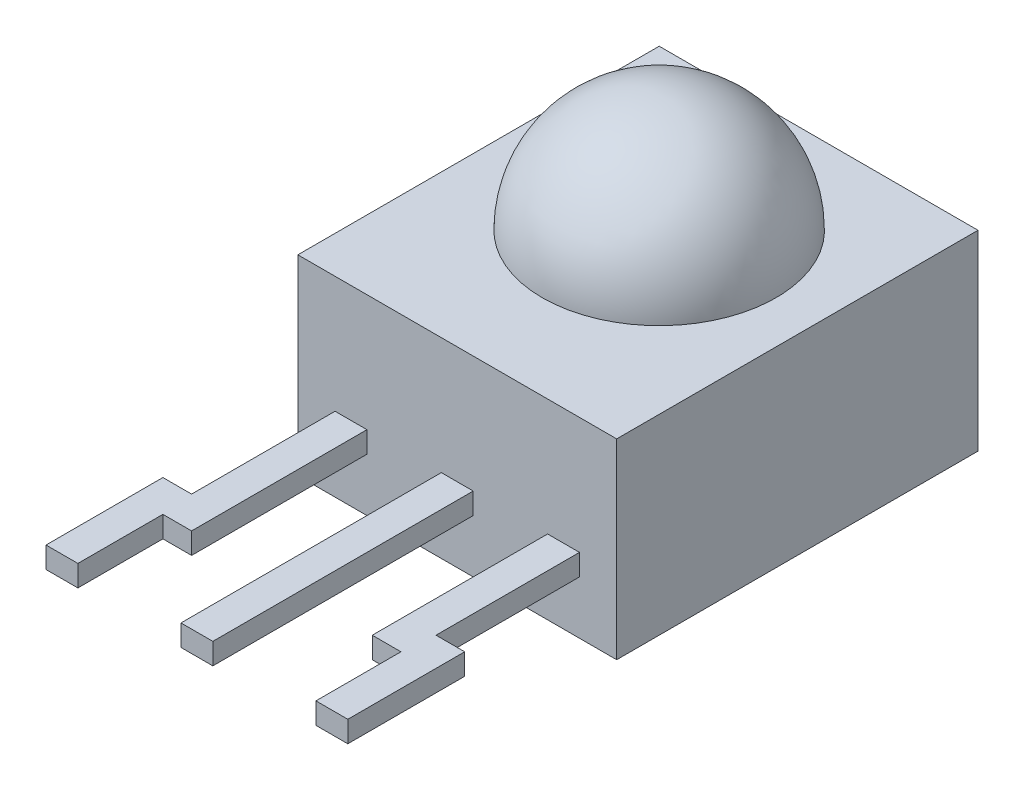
ISO-10303-21;
HEADER;
FILE_DESCRIPTION(('STEP AP214'),'2;1');
FILE_NAME('part.step','',(''),(''),'','','');
FILE_SCHEMA(('AUTOMOTIVE_DESIGN { 1 0 10303 214 1 1 1 1 }'));
ENDSEC;
DATA;
#1=APPLICATION_CONTEXT('core data for automotive mechanical design processes');
#2=APPLICATION_PROTOCOL_DEFINITION('international standard','automotive_design',2000,#1);
#3=PRODUCT_CONTEXT('',#1,'mechanical');
#4=PRODUCT('Part','Part','',(#3));
#5=PRODUCT_RELATED_PRODUCT_CATEGORY('part','',(#4));
#6=PRODUCT_DEFINITION_FORMATION('','',#4);
#7=PRODUCT_DEFINITION_CONTEXT('part definition',#1,'design');
#8=PRODUCT_DEFINITION('design','',#6,#7);
#9=PRODUCT_DEFINITION_SHAPE('','',#8);
#10=(LENGTH_UNIT() NAMED_UNIT(*) SI_UNIT(.MILLI.,.METRE.));
#11=(NAMED_UNIT(*) PLANE_ANGLE_UNIT() SI_UNIT($,.RADIAN.));
#12=(NAMED_UNIT(*) SI_UNIT($,.STERADIAN.) SOLID_ANGLE_UNIT());
#13=UNCERTAINTY_MEASURE_WITH_UNIT(LENGTH_MEASURE(1.E-05),#10,'distance_accuracy_value','');
#14=(GEOMETRIC_REPRESENTATION_CONTEXT(3) GLOBAL_UNCERTAINTY_ASSIGNED_CONTEXT((#13)) GLOBAL_UNIT_ASSIGNED_CONTEXT((#10,
#11,#12)) REPRESENTATION_CONTEXT('',''));
#15=CARTESIAN_POINT('',(0.,0.,0.));
#16=DIRECTION('',(0.,0.,1.));
#17=DIRECTION('',(1.,0.,0.));
#18=AXIS2_PLACEMENT_3D('',#15,#16,#17);
#19=CARTESIAN_POINT('',(-3.,2.4,0.));
#20=DIRECTION('',(0.,0.,-1.));
#21=DIRECTION('',(-1.,0.,0.));
#22=AXIS2_PLACEMENT_3D('',#19,#20,#21);
#23=PLANE('',#22);
#24=DIRECTION('',(-1.,0.,0.));
#25=VECTOR('',#24,1.);
#26=CARTESIAN_POINT('',(-2.3,0.2,0.));
#27=LINE('',#26,#25);
#28=CARTESIAN_POINT('',(-1.7,0.2,0.));
#29=VERTEX_POINT('',#28);
#30=CARTESIAN_POINT('',(-2.3,0.2,0.));
#31=VERTEX_POINT('',#30);
#32=EDGE_CURVE('E323',#29,#31,#27,.T.);
#33=ORIENTED_EDGE('',*,*,#32,.F.);
#34=DIRECTION('',(0.,1.,0.));
#35=VECTOR('',#34,1.);
#36=CARTESIAN_POINT('',(-1.7,0.2,0.));
#37=LINE('',#36,#35);
#38=CARTESIAN_POINT('',(-1.7,-0.2,0.));
#39=VERTEX_POINT('',#38);
#40=EDGE_CURVE('E320',#39,#29,#37,.T.);
#41=ORIENTED_EDGE('',*,*,#40,.F.);
#42=DIRECTION('',(1.,0.,0.));
#43=VECTOR('',#42,1.);
#44=CARTESIAN_POINT('',(-2.3,-0.2,0.));
#45=LINE('',#44,#43);
#46=CARTESIAN_POINT('',(-2.3,-0.2,0.));
#47=VERTEX_POINT('',#46);
#48=EDGE_CURVE('E317',#47,#39,#45,.T.);
#49=ORIENTED_EDGE('',*,*,#48,.F.);
#50=DIRECTION('',(0.,-1.,0.));
#51=VECTOR('',#50,1.);
#52=CARTESIAN_POINT('',(-2.3,0.2,0.));
#53=LINE('',#52,#51);
#54=EDGE_CURVE('E231',#31,#47,#53,.T.);
#55=ORIENTED_EDGE('',*,*,#54,.F.);
#56=EDGE_LOOP('',(#33,#41,#49,#55));
#57=FACE_BOUND('',#56,.T.);
#58=DIRECTION('',(1.,0.,0.));
#59=VECTOR('',#58,1.);
#60=CARTESIAN_POINT('',(-3.,-1.2,0.));
#61=LINE('',#60,#59);
#62=CARTESIAN_POINT('',(-3.,-1.2,0.));
#63=VERTEX_POINT('',#62);
#64=CARTESIAN_POINT('',(3.,-1.2,0.));
#65=VERTEX_POINT('',#64);
#66=EDGE_CURVE('E378',#63,#65,#61,.T.);
#67=ORIENTED_EDGE('',*,*,#66,.T.);
#68=DIRECTION('',(0.,-1.,0.));
#69=VECTOR('',#68,1.);
#70=CARTESIAN_POINT('',(3.,2.4,0.));
#71=LINE('',#70,#69);
#72=CARTESIAN_POINT('',(3.,2.4,0.));
#73=VERTEX_POINT('',#72);
#74=EDGE_CURVE('E45',#73,#65,#71,.T.);
#75=ORIENTED_EDGE('',*,*,#74,.F.);
#76=DIRECTION('',(1.,0.,0.));
#77=VECTOR('',#76,1.);
#78=CARTESIAN_POINT('',(-3.,2.4,0.));
#79=LINE('',#78,#77);
#80=CARTESIAN_POINT('',(-3.,2.4,0.));
#81=VERTEX_POINT('',#80);
#82=EDGE_CURVE('E368',#81,#73,#79,.T.);
#83=ORIENTED_EDGE('',*,*,#82,.F.);
#84=DIRECTION('',(0.,-1.,0.));
#85=VECTOR('',#84,1.);
#86=CARTESIAN_POINT('',(-3.,2.4,0.));
#87=LINE('',#86,#85);
#88=EDGE_CURVE('E12',#81,#63,#87,.T.);
#89=ORIENTED_EDGE('',*,*,#88,.T.);
#90=EDGE_LOOP('',(#67,#75,#83,#89));
#91=FACE_BOUND('',#90,.T.);
#92=DIRECTION('',(1.,0.,0.));
#93=VECTOR('',#92,1.);
#94=CARTESIAN_POINT('',(2.3,0.2,0.));
#95=LINE('',#94,#93);
#96=CARTESIAN_POINT('',(1.7,0.2,0.));
#97=VERTEX_POINT('',#96);
#98=CARTESIAN_POINT('',(2.3,0.2,0.));
#99=VERTEX_POINT('',#98);
#100=EDGE_CURVE('E254',#97,#99,#95,.T.);
#101=ORIENTED_EDGE('',*,*,#100,.T.);
#102=DIRECTION('',(0.,-1.,0.));
#103=VECTOR('',#102,1.);
#104=CARTESIAN_POINT('',(2.3,0.2,0.));
#105=LINE('',#104,#103);
#106=CARTESIAN_POINT('',(2.3,-0.2,0.));
#107=VERTEX_POINT('',#106);
#108=EDGE_CURVE('E222',#99,#107,#105,.T.);
#109=ORIENTED_EDGE('',*,*,#108,.T.);
#110=DIRECTION('',(-1.,0.,0.));
#111=VECTOR('',#110,1.);
#112=CARTESIAN_POINT('',(2.3,-0.2,0.));
#113=LINE('',#112,#111);
#114=CARTESIAN_POINT('',(1.7,-0.2,0.));
#115=VERTEX_POINT('',#114);
#116=EDGE_CURVE('E260',#107,#115,#113,.T.);
#117=ORIENTED_EDGE('',*,*,#116,.T.);
#118=DIRECTION('',(0.,1.,0.));
#119=VECTOR('',#118,1.);
#120=CARTESIAN_POINT('',(1.7,0.2,0.));
#121=LINE('',#120,#119);
#122=EDGE_CURVE('E257',#115,#97,#121,.T.);
#123=ORIENTED_EDGE('',*,*,#122,.T.);
#124=EDGE_LOOP('',(#101,#109,#117,#123));
#125=FACE_BOUND('',#124,.T.);
#126=DIRECTION('',(0.,-1.,0.));
#127=VECTOR('',#126,1.);
#128=CARTESIAN_POINT('',(-0.3,-0.2,0.));
#129=LINE('',#128,#127);
#130=CARTESIAN_POINT('',(-0.3,0.2,0.));
#131=VERTEX_POINT('',#130);
#132=CARTESIAN_POINT('',(-0.3,-0.2,0.));
#133=VERTEX_POINT('',#132);
#134=EDGE_CURVE('E218',#131,#133,#129,.T.);
#135=ORIENTED_EDGE('',*,*,#134,.F.);
#136=DIRECTION('',(-1.,0.,0.));
#137=VECTOR('',#136,1.);
#138=CARTESIAN_POINT('',(-0.3,0.2,0.));
#139=LINE('',#138,#137);
#140=CARTESIAN_POINT('',(0.3,0.2,0.));
#141=VERTEX_POINT('',#140);
#142=EDGE_CURVE('E215',#141,#131,#139,.T.);
#143=ORIENTED_EDGE('',*,*,#142,.F.);
#144=DIRECTION('',(0.,1.,0.));
#145=VECTOR('',#144,1.);
#146=CARTESIAN_POINT('',(0.3,-0.2,0.));
#147=LINE('',#146,#145);
#148=CARTESIAN_POINT('',(0.3,-0.2,0.));
#149=VERTEX_POINT('',#148);
#150=EDGE_CURVE('E57',#149,#141,#147,.T.);
#151=ORIENTED_EDGE('',*,*,#150,.F.);
#152=DIRECTION('',(1.,0.,0.));
#153=VECTOR('',#152,1.);
#154=CARTESIAN_POINT('',(-0.3,-0.2,0.));
#155=LINE('',#154,#153);
#156=EDGE_CURVE('E52',#133,#149,#155,.T.);
#157=ORIENTED_EDGE('',*,*,#156,.F.);
#158=EDGE_LOOP('',(#135,#143,#151,#157));
#159=FACE_BOUND('',#158,.T.);
#160=ADVANCED_FACE('F37',(#57,#91,#125,#159),#23,.F.);
#161=CARTESIAN_POINT('',(-3.,2.4,-6.8));
#162=DIRECTION('',(1.,0.,0.));
#163=DIRECTION('',(0.,0.,-1.));
#164=AXIS2_PLACEMENT_3D('',#161,#162,#163);
#165=PLANE('',#164);
#166=DIRECTION('',(0.,0.,1.));
#167=VECTOR('',#166,1.);
#168=CARTESIAN_POINT('',(-3.,-1.2,-6.8));
#169=LINE('',#168,#167);
#170=CARTESIAN_POINT('',(-3.,-1.2,-6.8));
#171=VERTEX_POINT('',#170);
#172=EDGE_CURVE('E364',#171,#63,#169,.T.);
#173=ORIENTED_EDGE('',*,*,#172,.T.);
#174=ORIENTED_EDGE('',*,*,#88,.F.);
#175=DIRECTION('',(0.,0.,1.));
#176=VECTOR('',#175,1.);
#177=CARTESIAN_POINT('',(-3.,2.4,-6.8));
#178=LINE('',#177,#176);
#179=CARTESIAN_POINT('',(-3.,2.4,-6.8));
#180=VERTEX_POINT('',#179);
#181=EDGE_CURVE('E365',#180,#81,#178,.T.);
#182=ORIENTED_EDGE('',*,*,#181,.F.);
#183=DIRECTION('',(0.,-1.,0.));
#184=VECTOR('',#183,1.);
#185=CARTESIAN_POINT('',(-3.,2.4,-6.8));
#186=LINE('',#185,#184);
#187=EDGE_CURVE('E375',#180,#171,#186,.T.);
#188=ORIENTED_EDGE('',*,*,#187,.T.);
#189=EDGE_LOOP('',(#173,#174,#182,#188));
#190=FACE_BOUND('',#189,.T.);
#191=ADVANCED_FACE('F405',(#190),#165,.F.);
#192=CARTESIAN_POINT('',(3.,2.4,-6.8));
#193=DIRECTION('',(-1.,0.,0.));
#194=DIRECTION('',(0.,0.,1.));
#195=AXIS2_PLACEMENT_3D('',#192,#193,#194);
#196=PLANE('',#195);
#197=DIRECTION('',(0.,0.,-1.));
#198=VECTOR('',#197,1.);
#199=CARTESIAN_POINT('',(3.,-1.2,-6.8));
#200=LINE('',#199,#198);
#201=CARTESIAN_POINT('',(3.,-1.2,-6.8));
#202=VERTEX_POINT('',#201);
#203=EDGE_CURVE('E380',#65,#202,#200,.T.);
#204=ORIENTED_EDGE('',*,*,#203,.T.);
#205=DIRECTION('',(0.,-1.,0.));
#206=VECTOR('',#205,1.);
#207=CARTESIAN_POINT('',(3.,2.4,-6.8));
#208=LINE('',#207,#206);
#209=CARTESIAN_POINT('',(3.,2.4,-6.8));
#210=VERTEX_POINT('',#209);
#211=EDGE_CURVE('E385',#210,#202,#208,.T.);
#212=ORIENTED_EDGE('',*,*,#211,.F.);
#213=DIRECTION('',(0.,0.,-1.));
#214=VECTOR('',#213,1.);
#215=CARTESIAN_POINT('',(3.,2.4,-6.8));
#216=LINE('',#215,#214);
#217=EDGE_CURVE('E371',#73,#210,#216,.T.);
#218=ORIENTED_EDGE('',*,*,#217,.F.);
#219=ORIENTED_EDGE('',*,*,#74,.T.);
#220=EDGE_LOOP('',(#204,#212,#218,#219));
#221=FACE_BOUND('',#220,.T.);
#222=ADVANCED_FACE('F392',(#221),#196,.F.);
#223=CARTESIAN_POINT('',(-3.,2.4,-6.8));
#224=DIRECTION('',(0.,0.,1.));
#225=DIRECTION('',(1.,0.,0.));
#226=AXIS2_PLACEMENT_3D('',#223,#224,#225);
#227=PLANE('',#226);
#228=DIRECTION('',(-1.,0.,0.));
#229=VECTOR('',#228,1.);
#230=CARTESIAN_POINT('',(-3.,-1.2,-6.8));
#231=LINE('',#230,#229);
#232=EDGE_CURVE('E369',#202,#171,#231,.T.);
#233=ORIENTED_EDGE('',*,*,#232,.T.);
#234=ORIENTED_EDGE('',*,*,#187,.F.);
#235=DIRECTION('',(-1.,0.,0.));
#236=VECTOR('',#235,1.);
#237=CARTESIAN_POINT('',(-3.,2.4,-6.8));
#238=LINE('',#237,#236);
#239=EDGE_CURVE('E373',#210,#180,#238,.T.);
#240=ORIENTED_EDGE('',*,*,#239,.F.);
#241=ORIENTED_EDGE('',*,*,#211,.T.);
#242=EDGE_LOOP('',(#233,#234,#240,#241));
#243=FACE_BOUND('',#242,.T.);
#244=ADVANCED_FACE('F401',(#243),#227,.F.);
#245=CARTESIAN_POINT('',(-3.,2.4,0.));
#246=DIRECTION('',(0.,1.,0.));
#247=DIRECTION('',(0.,0.,1.));
#248=AXIS2_PLACEMENT_3D('',#245,#246,#247);
#249=PLANE('',#248);
#250=CARTESIAN_POINT('',(0.,2.4,-3.8));
#251=DIRECTION('',(0.,1.,0.));
#252=DIRECTION('',(0.,0.,1.));
#253=AXIS2_PLACEMENT_3D('',#250,#251,#252);
#254=CIRCLE('',#253,2.2);
#255=CARTESIAN_POINT('',(0.,2.4,-1.6));
#256=VERTEX_POINT('',#255);
#257=EDGE_CURVE('E219',#256,#256,#254,.T.);
#258=ORIENTED_EDGE('',*,*,#257,.F.);
#259=EDGE_LOOP('',(#258));
#260=FACE_BOUND('',#259,.T.);
#261=ORIENTED_EDGE('',*,*,#181,.T.);
#262=ORIENTED_EDGE('',*,*,#82,.T.);
#263=ORIENTED_EDGE('',*,*,#217,.T.);
#264=ORIENTED_EDGE('',*,*,#239,.T.);
#265=EDGE_LOOP('',(#261,#262,#263,#264));
#266=FACE_BOUND('',#265,.T.);
#267=ADVANCED_FACE('F408',(#260,#266),#249,.T.);
#268=CARTESIAN_POINT('',(-3.,-1.2,0.));
#269=DIRECTION('',(0.,1.,0.));
#270=DIRECTION('',(0.,0.,1.));
#271=AXIS2_PLACEMENT_3D('',#268,#269,#270);
#272=PLANE('',#271);
#273=ORIENTED_EDGE('',*,*,#172,.F.);
#274=ORIENTED_EDGE('',*,*,#232,.F.);
#275=ORIENTED_EDGE('',*,*,#203,.F.);
#276=ORIENTED_EDGE('',*,*,#66,.F.);
#277=EDGE_LOOP('',(#273,#274,#275,#276));
#278=FACE_BOUND('',#277,.T.);
#279=ADVANCED_FACE('F398',(#278),#272,.F.);
#280=CARTESIAN_POINT('',(-2.84,0.2,2.7));
#281=DIRECTION('',(1.,0.,0.));
#282=DIRECTION('',(0.,0.,-1.));
#283=AXIS2_PLACEMENT_3D('',#280,#281,#282);
#284=PLANE('',#283);
#285=DIRECTION('',(0.,-1.,0.));
#286=VECTOR('',#285,1.);
#287=CARTESIAN_POINT('',(-2.84,0.2,4.9));
#288=LINE('',#287,#286);
#289=CARTESIAN_POINT('',(-2.84,0.2,4.9));
#290=VERTEX_POINT('',#289);
#291=CARTESIAN_POINT('',(-2.84,-0.2,4.9));
#292=VERTEX_POINT('',#291);
#293=EDGE_CURVE('E302',#290,#292,#288,.T.);
#294=ORIENTED_EDGE('',*,*,#293,.F.);
#295=DIRECTION('',(0.,0.,1.));
#296=VECTOR('',#295,1.);
#297=CARTESIAN_POINT('',(-2.84,0.2,2.7));
#298=LINE('',#297,#296);
#299=CARTESIAN_POINT('',(-2.84,0.2,2.7));
#300=VERTEX_POINT('',#299);
#301=EDGE_CURVE('E308',#300,#290,#298,.T.);
#302=ORIENTED_EDGE('',*,*,#301,.F.);
#303=DIRECTION('',(0.,1.,0.));
#304=VECTOR('',#303,1.);
#305=CARTESIAN_POINT('',(-2.84,0.2,2.7));
#306=LINE('',#305,#304);
#307=CARTESIAN_POINT('',(-2.84,-0.2,2.7));
#308=VERTEX_POINT('',#307);
#309=EDGE_CURVE('E309',#308,#300,#306,.T.);
#310=ORIENTED_EDGE('',*,*,#309,.F.);
#311=DIRECTION('',(0.,0.,1.));
#312=VECTOR('',#311,1.);
#313=CARTESIAN_POINT('',(-2.84,-0.2,2.7));
#314=LINE('',#313,#312);
#315=EDGE_CURVE('E300',#308,#292,#314,.T.);
#316=ORIENTED_EDGE('',*,*,#315,.T.);
#317=EDGE_LOOP('',(#294,#302,#310,#316));
#318=FACE_BOUND('',#317,.T.);
#319=ADVANCED_FACE('F506',(#318),#284,.F.);
#320=CARTESIAN_POINT('',(-2.24,0.2,3.3));
#321=DIRECTION('',(-1.,0.,0.));
#322=DIRECTION('',(0.,0.,1.));
#323=AXIS2_PLACEMENT_3D('',#320,#321,#322);
#324=PLANE('',#323);
#325=DIRECTION('',(0.,1.,0.));
#326=VECTOR('',#325,1.);
#327=CARTESIAN_POINT('',(-2.24,0.2,4.9));
#328=LINE('',#327,#326);
#329=CARTESIAN_POINT('',(-2.24,-0.2,4.9));
#330=VERTEX_POINT('',#329);
#331=CARTESIAN_POINT('',(-2.24,0.2,4.9));
#332=VERTEX_POINT('',#331);
#333=EDGE_CURVE('E297',#330,#332,#328,.T.);
#334=ORIENTED_EDGE('',*,*,#333,.F.);
#335=DIRECTION('',(0.,0.,1.));
#336=VECTOR('',#335,1.);
#337=CARTESIAN_POINT('',(-2.24,-0.2,3.3));
#338=LINE('',#337,#336);
#339=CARTESIAN_POINT('',(-2.24,-0.2,3.3));
#340=VERTEX_POINT('',#339);
#341=EDGE_CURVE('E358',#340,#330,#338,.T.);
#342=ORIENTED_EDGE('',*,*,#341,.F.);
#343=DIRECTION('',(0.,-1.,0.));
#344=VECTOR('',#343,1.);
#345=CARTESIAN_POINT('',(-2.24,0.2,3.3));
#346=LINE('',#345,#344);
#347=CARTESIAN_POINT('',(-2.24,0.2,3.3));
#348=VERTEX_POINT('',#347);
#349=EDGE_CURVE('E305',#348,#340,#346,.T.);
#350=ORIENTED_EDGE('',*,*,#349,.F.);
#351=DIRECTION('',(0.,0.,1.));
#352=VECTOR('',#351,1.);
#353=CARTESIAN_POINT('',(-2.24,0.2,3.3));
#354=LINE('',#353,#352);
#355=EDGE_CURVE('E355',#348,#332,#354,.T.);
#356=ORIENTED_EDGE('',*,*,#355,.T.);
#357=EDGE_LOOP('',(#334,#342,#350,#356));
#358=FACE_BOUND('',#357,.T.);
#359=ADVANCED_FACE('F501',(#358),#324,.F.);
#360=CARTESIAN_POINT('',(-1.7,0.2,3.3));
#361=DIRECTION('',(0.,0.,1.));
#362=DIRECTION('',(1.,0.,0.));
#363=AXIS2_PLACEMENT_3D('',#360,#361,#362);
#364=PLANE('',#363);
#365=DIRECTION('',(-1.,0.,0.));
#366=VECTOR('',#365,1.);
#367=CARTESIAN_POINT('',(-1.7,0.2,3.3));
#368=LINE('',#367,#366);
#369=CARTESIAN_POINT('',(-1.7,0.2,3.3));
#370=VERTEX_POINT('',#369);
#371=EDGE_CURVE('E339',#370,#348,#368,.T.);
#372=ORIENTED_EDGE('',*,*,#371,.T.);
#373=ORIENTED_EDGE('',*,*,#349,.T.);
#374=DIRECTION('',(-1.,0.,0.));
#375=VECTOR('',#374,1.);
#376=CARTESIAN_POINT('',(-1.7,-0.2,3.3));
#377=LINE('',#376,#375);
#378=CARTESIAN_POINT('',(-1.7,-0.2,3.3));
#379=VERTEX_POINT('',#378);
#380=EDGE_CURVE('E342',#379,#340,#377,.T.);
#381=ORIENTED_EDGE('',*,*,#380,.F.);
#382=DIRECTION('',(0.,1.,0.));
#383=VECTOR('',#382,1.);
#384=CARTESIAN_POINT('',(-1.7,0.2,3.3));
#385=LINE('',#384,#383);
#386=EDGE_CURVE('E310',#379,#370,#385,.T.);
#387=ORIENTED_EDGE('',*,*,#386,.T.);
#388=EDGE_LOOP('',(#372,#373,#381,#387));
#389=FACE_BOUND('',#388,.T.);
#390=ADVANCED_FACE('F498',(#389),#364,.T.);
#391=CARTESIAN_POINT('',(-2.3,0.2,2.7));
#392=DIRECTION('',(0.,0.,-1.));
#393=DIRECTION('',(-1.,0.,0.));
#394=AXIS2_PLACEMENT_3D('',#391,#392,#393);
#395=PLANE('',#394);
#396=DIRECTION('',(-1.,0.,0.));
#397=VECTOR('',#396,1.);
#398=CARTESIAN_POINT('',(-2.3,-0.2,2.7));
#399=LINE('',#398,#397);
#400=CARTESIAN_POINT('',(-2.3,-0.2,2.7));
#401=VERTEX_POINT('',#400);
#402=EDGE_CURVE('E345',#401,#308,#399,.T.);
#403=ORIENTED_EDGE('',*,*,#402,.T.);
#404=ORIENTED_EDGE('',*,*,#309,.T.);
#405=DIRECTION('',(-1.,0.,0.));
#406=VECTOR('',#405,1.);
#407=CARTESIAN_POINT('',(-2.3,0.2,2.7));
#408=LINE('',#407,#406);
#409=CARTESIAN_POINT('',(-2.3,0.2,2.7));
#410=VERTEX_POINT('',#409);
#411=EDGE_CURVE('E348',#410,#300,#408,.T.);
#412=ORIENTED_EDGE('',*,*,#411,.F.);
#413=DIRECTION('',(0.,-1.,0.));
#414=VECTOR('',#413,1.);
#415=CARTESIAN_POINT('',(-2.3,0.2,2.7));
#416=LINE('',#415,#414);
#417=EDGE_CURVE('E313',#410,#401,#416,.T.);
#418=ORIENTED_EDGE('',*,*,#417,.T.);
#419=EDGE_LOOP('',(#403,#404,#412,#418));
#420=FACE_BOUND('',#419,.T.);
#421=ADVANCED_FACE('F486',(#420),#395,.T.);
#422=CARTESIAN_POINT('',(-2.3,0.2,3.7211102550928));
#423=DIRECTION('',(0.,-1.,0.));
#424=DIRECTION('',(0.,0.,-1.));
#425=AXIS2_PLACEMENT_3D('',#422,#423,#424);
#426=PLANE('',#425);
#427=DIRECTION('',(0.,0.,-1.));
#428=VECTOR('',#427,1.);
#429=CARTESIAN_POINT('',(-2.3,0.2,3.7211102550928));
#430=LINE('',#429,#428);
#431=EDGE_CURVE('E326',#410,#31,#430,.T.);
#432=ORIENTED_EDGE('',*,*,#431,.F.);
#433=ORIENTED_EDGE('',*,*,#411,.T.);
#434=ORIENTED_EDGE('',*,*,#301,.T.);
#435=DIRECTION('',(-1.,0.,0.));
#436=VECTOR('',#435,1.);
#437=CARTESIAN_POINT('',(-2.0594448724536,0.2,4.9));
#438=LINE('',#437,#436);
#439=EDGE_CURVE('E299',#332,#290,#438,.T.);
#440=ORIENTED_EDGE('',*,*,#439,.F.);
#441=ORIENTED_EDGE('',*,*,#355,.F.);
#442=ORIENTED_EDGE('',*,*,#371,.F.);
#443=DIRECTION('',(0.,0.,-1.));
#444=VECTOR('',#443,1.);
#445=CARTESIAN_POINT('',(-1.7,0.2,3.7211102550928));
#446=LINE('',#445,#444);
#447=EDGE_CURVE('E329',#370,#29,#446,.T.);
#448=ORIENTED_EDGE('',*,*,#447,.T.);
#449=ORIENTED_EDGE('',*,*,#32,.T.);
#450=EDGE_LOOP('',(#432,#433,#434,#440,#441,#442,#448,#449));
#451=FACE_BOUND('',#450,.T.);
#452=ADVANCED_FACE('F482',(#451),#426,.F.);
#453=CARTESIAN_POINT('',(-1.7,0.2,3.7211102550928));
#454=DIRECTION('',(-1.,0.,0.));
#455=DIRECTION('',(0.,0.,1.));
#456=AXIS2_PLACEMENT_3D('',#453,#454,#455);
#457=PLANE('',#456);
#458=ORIENTED_EDGE('',*,*,#386,.F.);
#459=DIRECTION('',(0.,0.,-1.));
#460=VECTOR('',#459,1.);
#461=CARTESIAN_POINT('',(-1.7,-0.2,3.7211102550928));
#462=LINE('',#461,#460);
#463=EDGE_CURVE('E332',#379,#39,#462,.T.);
#464=ORIENTED_EDGE('',*,*,#463,.T.);
#465=ORIENTED_EDGE('',*,*,#40,.T.);
#466=ORIENTED_EDGE('',*,*,#447,.F.);
#467=EDGE_LOOP('',(#458,#464,#465,#466));
#468=FACE_BOUND('',#467,.T.);
#469=ADVANCED_FACE('F485',(#468),#457,.F.);
#470=CARTESIAN_POINT('',(-2.3,-0.2,3.7211102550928));
#471=DIRECTION('',(0.,1.,0.));
#472=DIRECTION('',(0.,0.,1.));
#473=AXIS2_PLACEMENT_3D('',#470,#471,#472);
#474=PLANE('',#473);
#475=ORIENTED_EDGE('',*,*,#463,.F.);
#476=ORIENTED_EDGE('',*,*,#380,.T.);
#477=ORIENTED_EDGE('',*,*,#341,.T.);
#478=DIRECTION('',(1.,0.,0.));
#479=VECTOR('',#478,1.);
#480=CARTESIAN_POINT('',(-2.0594448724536,-0.2,4.9));
#481=LINE('',#480,#479);
#482=EDGE_CURVE('E304',#292,#330,#481,.T.);
#483=ORIENTED_EDGE('',*,*,#482,.F.);
#484=ORIENTED_EDGE('',*,*,#315,.F.);
#485=ORIENTED_EDGE('',*,*,#402,.F.);
#486=DIRECTION('',(0.,0.,-1.));
#487=VECTOR('',#486,1.);
#488=CARTESIAN_POINT('',(-2.3,-0.2,3.7211102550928));
#489=LINE('',#488,#487);
#490=EDGE_CURVE('E314',#401,#47,#489,.T.);
#491=ORIENTED_EDGE('',*,*,#490,.T.);
#492=ORIENTED_EDGE('',*,*,#48,.T.);
#493=EDGE_LOOP('',(#475,#476,#477,#483,#484,#485,#491,#492));
#494=FACE_BOUND('',#493,.T.);
#495=ADVANCED_FACE('F490',(#494),#474,.F.);
#496=CARTESIAN_POINT('',(-2.3,0.2,3.7211102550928));
#497=DIRECTION('',(1.,0.,0.));
#498=DIRECTION('',(0.,0.,-1.));
#499=AXIS2_PLACEMENT_3D('',#496,#497,#498);
#500=PLANE('',#499);
#501=ORIENTED_EDGE('',*,*,#417,.F.);
#502=ORIENTED_EDGE('',*,*,#431,.T.);
#503=ORIENTED_EDGE('',*,*,#54,.T.);
#504=ORIENTED_EDGE('',*,*,#490,.F.);
#505=EDGE_LOOP('',(#501,#502,#503,#504));
#506=FACE_BOUND('',#505,.T.);
#507=ADVANCED_FACE('F480',(#506),#500,.F.);
#508=CARTESIAN_POINT('',(-2.54,0.,4.9));
#509=DIRECTION('',(0.,0.,1.));
#510=DIRECTION('',(1.,0.,0.));
#511=AXIS2_PLACEMENT_3D('',#508,#509,#510);
#512=PLANE('',#511);
#513=ORIENTED_EDGE('',*,*,#293,.T.);
#514=ORIENTED_EDGE('',*,*,#482,.T.);
#515=ORIENTED_EDGE('',*,*,#333,.T.);
#516=ORIENTED_EDGE('',*,*,#439,.T.);
#517=EDGE_LOOP('',(#513,#514,#515,#516));
#518=FACE_BOUND('',#517,.T.);
#519=ADVANCED_FACE('F473',(#518),#512,.T.);
#520=CARTESIAN_POINT('',(2.24,0.2,3.3));
#521=DIRECTION('',(-1.,0.,0.));
#522=DIRECTION('',(0.,0.,1.));
#523=AXIS2_PLACEMENT_3D('',#520,#521,#522);
#524=PLANE('',#523);
#525=DIRECTION('',(0.,0.,1.));
#526=VECTOR('',#525,1.);
#527=CARTESIAN_POINT('',(2.24,-0.2,3.3));
#528=LINE('',#527,#526);
#529=CARTESIAN_POINT('',(2.24,-0.2,3.3));
#530=VERTEX_POINT('',#529);
#531=CARTESIAN_POINT('',(2.24,-0.2,4.9));
#532=VERTEX_POINT('',#531);
#533=EDGE_CURVE('E292',#530,#532,#528,.T.);
#534=ORIENTED_EDGE('',*,*,#533,.T.);
#535=DIRECTION('',(0.,1.,0.));
#536=VECTOR('',#535,1.);
#537=CARTESIAN_POINT('',(2.24,0.2,4.9));
#538=LINE('',#537,#536);
#539=CARTESIAN_POINT('',(2.24,0.2,4.9));
#540=VERTEX_POINT('',#539);
#541=EDGE_CURVE('E235',#532,#540,#538,.T.);
#542=ORIENTED_EDGE('',*,*,#541,.T.);
#543=DIRECTION('',(0.,0.,1.));
#544=VECTOR('',#543,1.);
#545=CARTESIAN_POINT('',(2.24,0.2,3.3));
#546=LINE('',#545,#544);
#547=CARTESIAN_POINT('',(2.24,0.2,3.3));
#548=VERTEX_POINT('',#547);
#549=EDGE_CURVE('E246',#548,#540,#546,.T.);
#550=ORIENTED_EDGE('',*,*,#549,.F.);
#551=DIRECTION('',(0.,-1.,0.));
#552=VECTOR('',#551,1.);
#553=CARTESIAN_POINT('',(2.24,0.2,3.3));
#554=LINE('',#553,#552);
#555=EDGE_CURVE('E242',#548,#530,#554,.T.);
#556=ORIENTED_EDGE('',*,*,#555,.T.);
#557=EDGE_LOOP('',(#534,#542,#550,#556));
#558=FACE_BOUND('',#557,.T.);
#559=ADVANCED_FACE('F470',(#558),#524,.T.);
#560=CARTESIAN_POINT('',(2.84,0.2,2.7));
#561=DIRECTION('',(1.,0.,0.));
#562=DIRECTION('',(0.,0.,-1.));
#563=AXIS2_PLACEMENT_3D('',#560,#561,#562);
#564=PLANE('',#563);
#565=DIRECTION('',(0.,0.,1.));
#566=VECTOR('',#565,1.);
#567=CARTESIAN_POINT('',(2.84,0.2,2.7));
#568=LINE('',#567,#566);
#569=CARTESIAN_POINT('',(2.84,0.2,2.7));
#570=VERTEX_POINT('',#569);
#571=CARTESIAN_POINT('',(2.84,0.2,4.9));
#572=VERTEX_POINT('',#571);
#573=EDGE_CURVE('E286',#570,#572,#568,.T.);
#574=ORIENTED_EDGE('',*,*,#573,.T.);
#575=DIRECTION('',(0.,-1.,0.));
#576=VECTOR('',#575,1.);
#577=CARTESIAN_POINT('',(2.84,0.2,4.9));
#578=LINE('',#577,#576);
#579=CARTESIAN_POINT('',(2.84,-0.2,4.9));
#580=VERTEX_POINT('',#579);
#581=EDGE_CURVE('E228',#572,#580,#578,.T.);
#582=ORIENTED_EDGE('',*,*,#581,.T.);
#583=DIRECTION('',(0.,0.,1.));
#584=VECTOR('',#583,1.);
#585=CARTESIAN_POINT('',(2.84,-0.2,2.7));
#586=LINE('',#585,#584);
#587=CARTESIAN_POINT('',(2.84,-0.2,2.7));
#588=VERTEX_POINT('',#587);
#589=EDGE_CURVE('E289',#588,#580,#586,.T.);
#590=ORIENTED_EDGE('',*,*,#589,.F.);
#591=DIRECTION('',(0.,1.,0.));
#592=VECTOR('',#591,1.);
#593=CARTESIAN_POINT('',(2.84,0.2,2.7));
#594=LINE('',#593,#592);
#595=EDGE_CURVE('E239',#588,#570,#594,.T.);
#596=ORIENTED_EDGE('',*,*,#595,.T.);
#597=EDGE_LOOP('',(#574,#582,#590,#596));
#598=FACE_BOUND('',#597,.T.);
#599=ADVANCED_FACE('F465',(#598),#564,.T.);
#600=CARTESIAN_POINT('',(1.7,0.2,3.3));
#601=DIRECTION('',(0.,0.,-1.));
#602=DIRECTION('',(-1.,0.,0.));
#603=AXIS2_PLACEMENT_3D('',#600,#601,#602);
#604=PLANE('',#603);
#605=ORIENTED_EDGE('',*,*,#555,.F.);
#606=DIRECTION('',(1.,0.,0.));
#607=VECTOR('',#606,1.);
#608=CARTESIAN_POINT('',(1.7,0.2,3.3));
#609=LINE('',#608,#607);
#610=CARTESIAN_POINT('',(1.7,0.2,3.3));
#611=VERTEX_POINT('',#610);
#612=EDGE_CURVE('E250',#611,#548,#609,.T.);
#613=ORIENTED_EDGE('',*,*,#612,.F.);
#614=DIRECTION('',(0.,1.,0.));
#615=VECTOR('',#614,1.);
#616=CARTESIAN_POINT('',(1.7,0.2,3.3));
#617=LINE('',#616,#615);
#618=CARTESIAN_POINT('',(1.7,-0.2,3.3));
#619=VERTEX_POINT('',#618);
#620=EDGE_CURVE('E247',#619,#611,#617,.T.);
#621=ORIENTED_EDGE('',*,*,#620,.F.);
#622=DIRECTION('',(1.,0.,0.));
#623=VECTOR('',#622,1.);
#624=CARTESIAN_POINT('',(1.7,-0.2,3.3));
#625=LINE('',#624,#623);
#626=EDGE_CURVE('E243',#619,#530,#625,.T.);
#627=ORIENTED_EDGE('',*,*,#626,.T.);
#628=EDGE_LOOP('',(#605,#613,#621,#627));
#629=FACE_BOUND('',#628,.T.);
#630=ADVANCED_FACE('F462',(#629),#604,.F.);
#631=CARTESIAN_POINT('',(2.3,0.2,2.7));
#632=DIRECTION('',(0.,0.,1.));
#633=DIRECTION('',(1.,0.,0.));
#634=AXIS2_PLACEMENT_3D('',#631,#632,#633);
#635=PLANE('',#634);
#636=ORIENTED_EDGE('',*,*,#595,.F.);
#637=DIRECTION('',(1.,0.,0.));
#638=VECTOR('',#637,1.);
#639=CARTESIAN_POINT('',(2.3,-0.2,2.7));
#640=LINE('',#639,#638);
#641=CARTESIAN_POINT('',(2.3,-0.2,2.7));
#642=VERTEX_POINT('',#641);
#643=EDGE_CURVE('E279',#642,#588,#640,.T.);
#644=ORIENTED_EDGE('',*,*,#643,.F.);
#645=DIRECTION('',(0.,-1.,0.));
#646=VECTOR('',#645,1.);
#647=CARTESIAN_POINT('',(2.3,0.2,2.7));
#648=LINE('',#647,#646);
#649=CARTESIAN_POINT('',(2.3,0.2,2.7));
#650=VERTEX_POINT('',#649);
#651=EDGE_CURVE('E251',#650,#642,#648,.T.);
#652=ORIENTED_EDGE('',*,*,#651,.F.);
#653=DIRECTION('',(1.,0.,0.));
#654=VECTOR('',#653,1.);
#655=CARTESIAN_POINT('',(2.3,0.2,2.7));
#656=LINE('',#655,#654);
#657=EDGE_CURVE('E276',#650,#570,#656,.T.);
#658=ORIENTED_EDGE('',*,*,#657,.T.);
#659=EDGE_LOOP('',(#636,#644,#652,#658));
#660=FACE_BOUND('',#659,.T.);
#661=ADVANCED_FACE('F460',(#660),#635,.F.);
#662=CARTESIAN_POINT('',(2.3,0.2,3.7211102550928));
#663=DIRECTION('',(1.,0.,0.));
#664=DIRECTION('',(0.,0.,-1.));
#665=AXIS2_PLACEMENT_3D('',#662,#663,#664);
#666=PLANE('',#665);
#667=DIRECTION('',(0.,0.,-1.));
#668=VECTOR('',#667,1.);
#669=CARTESIAN_POINT('',(2.3,0.2,3.7211102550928));
#670=LINE('',#669,#668);
#671=EDGE_CURVE('E269',#650,#99,#670,.T.);
#672=ORIENTED_EDGE('',*,*,#671,.F.);
#673=ORIENTED_EDGE('',*,*,#651,.T.);
#674=DIRECTION('',(0.,0.,-1.));
#675=VECTOR('',#674,1.);
#676=CARTESIAN_POINT('',(2.3,-0.2,3.7211102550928));
#677=LINE('',#676,#675);
#678=EDGE_CURVE('E263',#642,#107,#677,.T.);
#679=ORIENTED_EDGE('',*,*,#678,.T.);
#680=ORIENTED_EDGE('',*,*,#108,.F.);
#681=EDGE_LOOP('',(#672,#673,#679,#680));
#682=FACE_BOUND('',#681,.T.);
#683=ADVANCED_FACE('F450',(#682),#666,.T.);
#684=CARTESIAN_POINT('',(2.3,-0.2,3.7211102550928));
#685=DIRECTION('',(0.,-1.,0.));
#686=DIRECTION('',(0.,0.,-1.));
#687=AXIS2_PLACEMENT_3D('',#684,#685,#686);
#688=PLANE('',#687);
#689=ORIENTED_EDGE('',*,*,#678,.F.);
#690=ORIENTED_EDGE('',*,*,#643,.T.);
#691=ORIENTED_EDGE('',*,*,#589,.T.);
#692=DIRECTION('',(-1.,0.,0.));
#693=VECTOR('',#692,1.);
#694=CARTESIAN_POINT('',(2.0594448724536,-0.2,4.9));
#695=LINE('',#694,#693);
#696=EDGE_CURVE('E238',#580,#532,#695,.T.);
#697=ORIENTED_EDGE('',*,*,#696,.T.);
#698=ORIENTED_EDGE('',*,*,#533,.F.);
#699=ORIENTED_EDGE('',*,*,#626,.F.);
#700=DIRECTION('',(0.,0.,-1.));
#701=VECTOR('',#700,1.);
#702=CARTESIAN_POINT('',(1.7,-0.2,3.7211102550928));
#703=LINE('',#702,#701);
#704=EDGE_CURVE('E265',#619,#115,#703,.T.);
#705=ORIENTED_EDGE('',*,*,#704,.T.);
#706=ORIENTED_EDGE('',*,*,#116,.F.);
#707=EDGE_LOOP('',(#689,#690,#691,#697,#698,#699,#705,#706));
#708=FACE_BOUND('',#707,.T.);
#709=ADVANCED_FACE('F446',(#708),#688,.T.);
#710=CARTESIAN_POINT('',(1.7,0.2,3.7211102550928));
#711=DIRECTION('',(-1.,0.,0.));
#712=DIRECTION('',(0.,0.,1.));
#713=AXIS2_PLACEMENT_3D('',#710,#711,#712);
#714=PLANE('',#713);
#715=ORIENTED_EDGE('',*,*,#704,.F.);
#716=ORIENTED_EDGE('',*,*,#620,.T.);
#717=DIRECTION('',(0.,0.,-1.));
#718=VECTOR('',#717,1.);
#719=CARTESIAN_POINT('',(1.7,0.2,3.7211102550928));
#720=LINE('',#719,#718);
#721=EDGE_CURVE('E267',#611,#97,#720,.T.);
#722=ORIENTED_EDGE('',*,*,#721,.T.);
#723=ORIENTED_EDGE('',*,*,#122,.F.);
#724=EDGE_LOOP('',(#715,#716,#722,#723));
#725=FACE_BOUND('',#724,.T.);
#726=ADVANCED_FACE('F449',(#725),#714,.T.);
#727=CARTESIAN_POINT('',(2.3,0.2,3.7211102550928));
#728=DIRECTION('',(0.,1.,0.));
#729=DIRECTION('',(0.,0.,1.));
#730=AXIS2_PLACEMENT_3D('',#727,#728,#729);
#731=PLANE('',#730);
#732=ORIENTED_EDGE('',*,*,#721,.F.);
#733=ORIENTED_EDGE('',*,*,#612,.T.);
#734=ORIENTED_EDGE('',*,*,#549,.T.);
#735=DIRECTION('',(1.,0.,0.));
#736=VECTOR('',#735,1.);
#737=CARTESIAN_POINT('',(2.0594448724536,0.2,4.9));
#738=LINE('',#737,#736);
#739=EDGE_CURVE('E232',#540,#572,#738,.T.);
#740=ORIENTED_EDGE('',*,*,#739,.T.);
#741=ORIENTED_EDGE('',*,*,#573,.F.);
#742=ORIENTED_EDGE('',*,*,#657,.F.);
#743=ORIENTED_EDGE('',*,*,#671,.T.);
#744=ORIENTED_EDGE('',*,*,#100,.F.);
#745=EDGE_LOOP('',(#732,#733,#734,#740,#741,#742,#743,#744));
#746=FACE_BOUND('',#745,.T.);
#747=ADVANCED_FACE('F444',(#746),#731,.T.);
#748=CARTESIAN_POINT('',(2.54,0.,4.9));
#749=DIRECTION('',(0.,0.,1.));
#750=DIRECTION('',(1.,0.,0.));
#751=AXIS2_PLACEMENT_3D('',#748,#749,#750);
#752=PLANE('',#751);
#753=ORIENTED_EDGE('',*,*,#696,.F.);
#754=ORIENTED_EDGE('',*,*,#581,.F.);
#755=ORIENTED_EDGE('',*,*,#739,.F.);
#756=ORIENTED_EDGE('',*,*,#541,.F.);
#757=EDGE_LOOP('',(#753,#754,#755,#756));
#758=FACE_BOUND('',#757,.T.);
#759=ADVANCED_FACE('F441',(#758),#752,.T.);
#760=CARTESIAN_POINT('',(0.,2.4,-3.8));
#761=DIRECTION('',(0.,0.,1.));
#762=DIRECTION('',(1.,0.,0.));
#763=AXIS2_PLACEMENT_3D('',#760,#761,#762);
#764=SPHERICAL_SURFACE('',#763,2.2);
#765=CARTESIAN_POINT('',(0.,2.4,-3.8));
#766=DIRECTION('',(0.,1.,0.));
#767=DIRECTION('',(0.,0.,1.));
#768=AXIS2_PLACEMENT_3D('',#765,#766,#767);
#769=SPHERICAL_SURFACE('',#768,2.2);
#770=ORIENTED_EDGE('',*,*,#257,.T.);
#771=EDGE_LOOP('',(#770));
#772=FACE_BOUND('',#771,.T.);
#773=ADVANCED_FACE('F39',(#772),#769,.T.);
#774=CARTESIAN_POINT('',(-0.3,-0.2,4.9));
#775=DIRECTION('',(1.,0.,0.));
#776=DIRECTION('',(0.,0.,-1.));
#777=AXIS2_PLACEMENT_3D('',#774,#775,#776);
#778=PLANE('',#777);
#779=ORIENTED_EDGE('',*,*,#134,.T.);
#780=DIRECTION('',(0.,0.,-1.));
#781=VECTOR('',#780,1.);
#782=CARTESIAN_POINT('',(-0.3,-0.2,4.9));
#783=LINE('',#782,#781);
#784=CARTESIAN_POINT('',(-0.3,-0.2,4.9));
#785=VERTEX_POINT('',#784);
#786=EDGE_CURVE('E199',#785,#133,#783,.T.);
#787=ORIENTED_EDGE('',*,*,#786,.F.);
#788=DIRECTION('',(0.,-1.,0.));
#789=VECTOR('',#788,1.);
#790=CARTESIAN_POINT('',(-0.3,-0.2,4.9));
#791=LINE('',#790,#789);
#792=CARTESIAN_POINT('',(-0.3,0.2,4.9));
#793=VERTEX_POINT('',#792);
#794=EDGE_CURVE('E206',#793,#785,#791,.T.);
#795=ORIENTED_EDGE('',*,*,#794,.F.);
#796=DIRECTION('',(0.,0.,-1.));
#797=VECTOR('',#796,1.);
#798=CARTESIAN_POINT('',(-0.3,0.2,4.9));
#799=LINE('',#798,#797);
#800=EDGE_CURVE('E419',#793,#131,#799,.T.);
#801=ORIENTED_EDGE('',*,*,#800,.T.);
#802=EDGE_LOOP('',(#779,#787,#795,#801));
#803=FACE_BOUND('',#802,.T.);
#804=ADVANCED_FACE('F217',(#803),#778,.F.);
#805=CARTESIAN_POINT('',(-0.3,-0.2,4.9));
#806=DIRECTION('',(0.,1.,0.));
#807=DIRECTION('',(0.,0.,1.));
#808=AXIS2_PLACEMENT_3D('',#805,#806,#807);
#809=PLANE('',#808);
#810=ORIENTED_EDGE('',*,*,#156,.T.);
#811=DIRECTION('',(0.,0.,-1.));
#812=VECTOR('',#811,1.);
#813=CARTESIAN_POINT('',(0.3,-0.2,4.9));
#814=LINE('',#813,#812);
#815=CARTESIAN_POINT('',(0.3,-0.2,4.9));
#816=VERTEX_POINT('',#815);
#817=EDGE_CURVE('E202',#816,#149,#814,.T.);
#818=ORIENTED_EDGE('',*,*,#817,.F.);
#819=DIRECTION('',(1.,0.,0.));
#820=VECTOR('',#819,1.);
#821=CARTESIAN_POINT('',(-0.3,-0.2,4.9));
#822=LINE('',#821,#820);
#823=EDGE_CURVE('E195',#785,#816,#822,.T.);
#824=ORIENTED_EDGE('',*,*,#823,.F.);
#825=ORIENTED_EDGE('',*,*,#786,.T.);
#826=EDGE_LOOP('',(#810,#818,#824,#825));
#827=FACE_BOUND('',#826,.T.);
#828=ADVANCED_FACE('F197',(#827),#809,.F.);
#829=CARTESIAN_POINT('',(0.3,-0.2,4.9));
#830=DIRECTION('',(-1.,0.,0.));
#831=DIRECTION('',(0.,0.,1.));
#832=AXIS2_PLACEMENT_3D('',#829,#830,#831);
#833=PLANE('',#832);
#834=ORIENTED_EDGE('',*,*,#150,.T.);
#835=DIRECTION('',(0.,0.,-1.));
#836=VECTOR('',#835,1.);
#837=CARTESIAN_POINT('',(0.3,0.2,4.9));
#838=LINE('',#837,#836);
#839=CARTESIAN_POINT('',(0.3,0.2,4.9));
#840=VERTEX_POINT('',#839);
#841=EDGE_CURVE('E224',#840,#141,#838,.T.);
#842=ORIENTED_EDGE('',*,*,#841,.F.);
#843=DIRECTION('',(0.,1.,0.));
#844=VECTOR('',#843,1.);
#845=CARTESIAN_POINT('',(0.3,-0.2,4.9));
#846=LINE('',#845,#844);
#847=EDGE_CURVE('E205',#816,#840,#846,.T.);
#848=ORIENTED_EDGE('',*,*,#847,.F.);
#849=ORIENTED_EDGE('',*,*,#817,.T.);
#850=EDGE_LOOP('',(#834,#842,#848,#849));
#851=FACE_BOUND('',#850,.T.);
#852=ADVANCED_FACE('F428',(#851),#833,.F.);
#853=CARTESIAN_POINT('',(-0.3,0.2,4.9));
#854=DIRECTION('',(0.,-1.,0.));
#855=DIRECTION('',(0.,0.,-1.));
#856=AXIS2_PLACEMENT_3D('',#853,#854,#855);
#857=PLANE('',#856);
#858=ORIENTED_EDGE('',*,*,#142,.T.);
#859=ORIENTED_EDGE('',*,*,#800,.F.);
#860=DIRECTION('',(-1.,0.,0.));
#861=VECTOR('',#860,1.);
#862=CARTESIAN_POINT('',(-0.3,0.2,4.9));
#863=LINE('',#862,#861);
#864=EDGE_CURVE('E211',#840,#793,#863,.T.);
#865=ORIENTED_EDGE('',*,*,#864,.F.);
#866=ORIENTED_EDGE('',*,*,#841,.T.);
#867=EDGE_LOOP('',(#858,#859,#865,#866));
#868=FACE_BOUND('',#867,.T.);
#869=ADVANCED_FACE('F418',(#868),#857,.F.);
#870=CARTESIAN_POINT('',(0.,0.,4.9));
#871=DIRECTION('',(0.,0.,-1.));
#872=DIRECTION('',(-1.,0.,0.));
#873=AXIS2_PLACEMENT_3D('',#870,#871,#872);
#874=PLANE('',#873);
#875=ORIENTED_EDGE('',*,*,#794,.T.);
#876=ORIENTED_EDGE('',*,*,#823,.T.);
#877=ORIENTED_EDGE('',*,*,#847,.T.);
#878=ORIENTED_EDGE('',*,*,#864,.T.);
#879=EDGE_LOOP('',(#875,#876,#877,#878));
#880=FACE_BOUND('',#879,.T.);
#881=ADVANCED_FACE('F209',(#880),#874,.F.);
#882=CLOSED_SHELL('',(#160,#191,#222,#244,#267,#279,#319,#359,#390,#421,#452,#469,#495,#507,
#519,#559,#599,#630,#661,#683,#709,#726,#747,#759,#773,#804,#828,#852,#869,#881));
#883=MANIFOLD_SOLID_BREP('B2',#882);
#884=ADVANCED_BREP_SHAPE_REPRESENTATION('',(#18,#883),#14);
#885=SHAPE_DEFINITION_REPRESENTATION(#9,#884);
ENDSEC;
END-ISO-10303-21;
